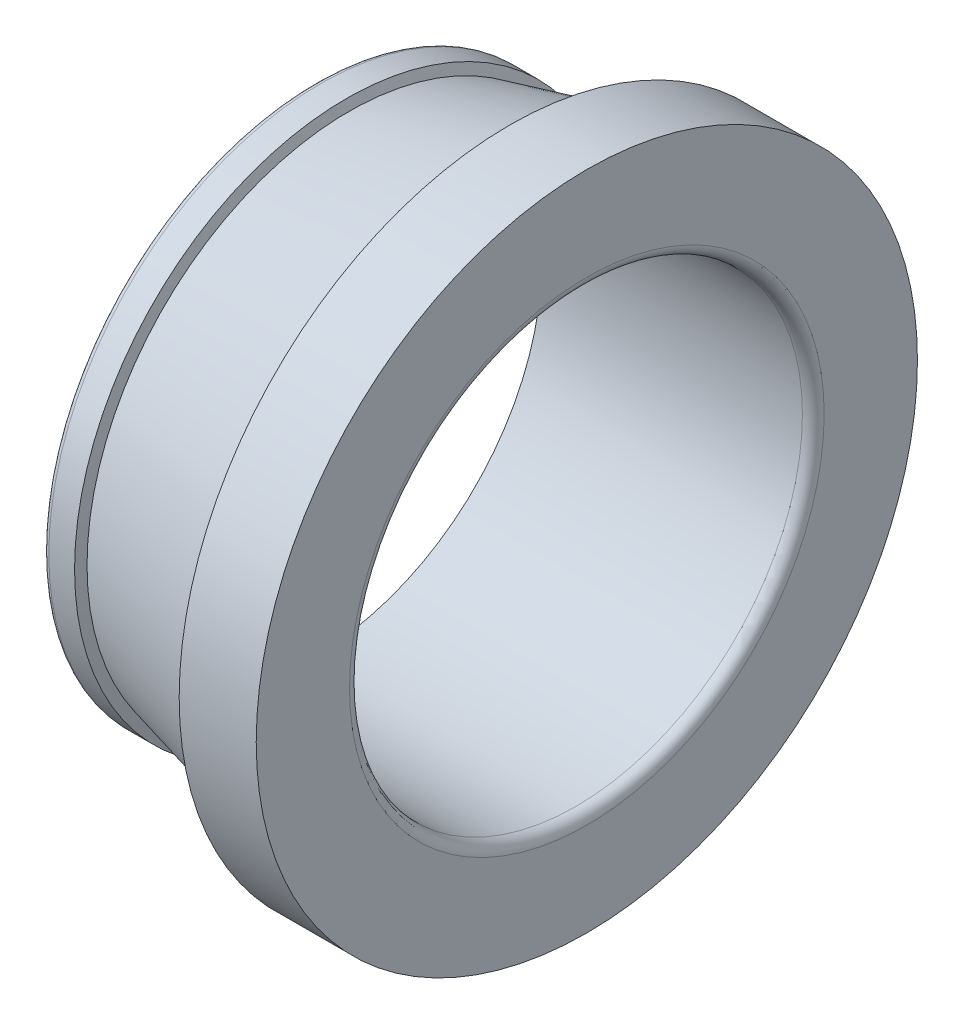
ISO-10303-21;
HEADER;
FILE_DESCRIPTION(('STEP AP214'),'2;1');
FILE_NAME('part.step','',(''),(''),'','','');
FILE_SCHEMA(('AUTOMOTIVE_DESIGN { 1 0 10303 214 1 1 1 1 }'));
ENDSEC;
DATA;
#1=APPLICATION_CONTEXT('core data for automotive mechanical design processes');
#2=APPLICATION_PROTOCOL_DEFINITION('international standard','automotive_design',2000,#1);
#3=PRODUCT_CONTEXT('',#1,'mechanical');
#4=PRODUCT('Part','Part','',(#3));
#5=PRODUCT_RELATED_PRODUCT_CATEGORY('part','',(#4));
#6=PRODUCT_DEFINITION_FORMATION('','',#4);
#7=PRODUCT_DEFINITION_CONTEXT('part definition',#1,'design');
#8=PRODUCT_DEFINITION('design','',#6,#7);
#9=PRODUCT_DEFINITION_SHAPE('','',#8);
#10=(LENGTH_UNIT() NAMED_UNIT(*) SI_UNIT(.MILLI.,.METRE.));
#11=(NAMED_UNIT(*) PLANE_ANGLE_UNIT() SI_UNIT($,.RADIAN.));
#12=(NAMED_UNIT(*) SI_UNIT($,.STERADIAN.) SOLID_ANGLE_UNIT());
#13=UNCERTAINTY_MEASURE_WITH_UNIT(LENGTH_MEASURE(1.E-05),#10,'distance_accuracy_value','');
#14=(GEOMETRIC_REPRESENTATION_CONTEXT(3) GLOBAL_UNCERTAINTY_ASSIGNED_CONTEXT((#13)) GLOBAL_UNIT_ASSIGNED_CONTEXT((#10,
#11,#12)) REPRESENTATION_CONTEXT('',''));
#15=CARTESIAN_POINT('',(0.,0.,0.));
#16=DIRECTION('',(0.,0.,1.));
#17=DIRECTION('',(1.,0.,0.));
#18=AXIS2_PLACEMENT_3D('',#15,#16,#17);
#19=CARTESIAN_POINT('',(0.,14.7,0.));
#20=DIRECTION('',(1.,0.,0.));
#21=DIRECTION('',(0.,0.,-1.));
#22=AXIS2_PLACEMENT_3D('',#19,#20,#21);
#23=PLANE('',#22);
#24=CARTESIAN_POINT('',(0.,0.,0.));
#25=DIRECTION('',(-1.,0.,0.));
#26=DIRECTION('',(0.,0.,1.));
#27=AXIS2_PLACEMENT_3D('',#24,#25,#26);
#28=CIRCLE('',#27,12.5);
#29=CARTESIAN_POINT('',(0.,0.,12.5));
#30=VERTEX_POINT('',#29);
#31=EDGE_CURVE('E9',#30,#30,#28,.T.);
#32=ORIENTED_EDGE('',*,*,#31,.F.);
#33=EDGE_LOOP('',(#32));
#34=FACE_BOUND('',#33,.T.);
#35=CARTESIAN_POINT('',(0.,0.,0.));
#36=DIRECTION('',(-1.,0.,0.));
#37=DIRECTION('',(0.,0.,1.));
#38=AXIS2_PLACEMENT_3D('',#35,#36,#37);
#39=CIRCLE('',#38,14.7);
#40=CARTESIAN_POINT('',(0.,0.,14.7));
#41=VERTEX_POINT('',#40);
#42=EDGE_CURVE('E48',#41,#41,#39,.T.);
#43=ORIENTED_EDGE('',*,*,#42,.T.);
#44=EDGE_LOOP('',(#43));
#45=FACE_BOUND('',#44,.T.);
#46=ADVANCED_FACE('F14',(#34,#45),#23,.F.);
#47=CARTESIAN_POINT('',(0.,0.,0.));
#48=DIRECTION('',(-1.,0.,0.));
#49=DIRECTION('',(0.,0.,1.));
#50=AXIS2_PLACEMENT_3D('',#47,#48,#49);
#51=CYLINDRICAL_SURFACE('',#50,12.5);
#52=CARTESIAN_POINT('',(14.4,0.,0.));
#53=DIRECTION('',(-1.,0.,0.));
#54=DIRECTION('',(0.,0.,1.));
#55=AXIS2_PLACEMENT_3D('',#52,#53,#54);
#56=CIRCLE('',#55,12.5);
#57=CARTESIAN_POINT('',(14.4,0.,12.5));
#58=VERTEX_POINT('',#57);
#59=EDGE_CURVE('E20',#58,#58,#56,.T.);
#60=ORIENTED_EDGE('',*,*,#59,.F.);
#61=EDGE_LOOP('',(#60));
#62=FACE_BOUND('',#61,.T.);
#63=ORIENTED_EDGE('',*,*,#31,.T.);
#64=EDGE_LOOP('',(#63));
#65=FACE_BOUND('',#64,.T.);
#66=ADVANCED_FACE('F72',(#62,#65),#51,.F.);
#67=CARTESIAN_POINT('',(14.4,0.,0.));
#68=DIRECTION('',(-1.,0.,0.));
#69=DIRECTION('',(0.,0.,1.));
#70=AXIS2_PLACEMENT_3D('',#67,#68,#69);
#71=TOROIDAL_SURFACE('',#70,13.1,0.6);
#72=CARTESIAN_POINT('',(15.,0.,0.));
#73=DIRECTION('',(-1.,0.,0.));
#74=DIRECTION('',(0.,0.,1.));
#75=AXIS2_PLACEMENT_3D('',#72,#73,#74);
#76=CIRCLE('',#75,13.1);
#77=CARTESIAN_POINT('',(15.,0.,13.1));
#78=VERTEX_POINT('',#77);
#79=EDGE_CURVE('E24',#78,#78,#76,.T.);
#80=ORIENTED_EDGE('',*,*,#79,.F.);
#81=EDGE_LOOP('',(#80));
#82=FACE_BOUND('',#81,.T.);
#83=ORIENTED_EDGE('',*,*,#59,.T.);
#84=EDGE_LOOP('',(#83));
#85=FACE_BOUND('',#84,.T.);
#86=ADVANCED_FACE('F77',(#82,#85),#71,.T.);
#87=CARTESIAN_POINT('',(15.,13.1,0.));
#88=DIRECTION('',(-1.,0.,0.));
#89=DIRECTION('',(0.,0.,1.));
#90=AXIS2_PLACEMENT_3D('',#87,#88,#89);
#91=PLANE('',#90);
#92=CARTESIAN_POINT('',(15.,0.,0.));
#93=DIRECTION('',(-1.,0.,0.));
#94=DIRECTION('',(0.,0.,1.));
#95=AXIS2_PLACEMENT_3D('',#92,#93,#94);
#96=CIRCLE('',#95,18.25);
#97=CARTESIAN_POINT('',(15.,0.,18.25));
#98=VERTEX_POINT('',#97);
#99=EDGE_CURVE('E28',#98,#98,#96,.T.);
#100=ORIENTED_EDGE('',*,*,#99,.F.);
#101=EDGE_LOOP('',(#100));
#102=FACE_BOUND('',#101,.T.);
#103=ORIENTED_EDGE('',*,*,#79,.T.);
#104=EDGE_LOOP('',(#103));
#105=FACE_BOUND('',#104,.T.);
#106=ADVANCED_FACE('F82',(#102,#105),#91,.F.);
#107=CARTESIAN_POINT('',(0.,0.,0.));
#108=DIRECTION('',(-1.,0.,0.));
#109=DIRECTION('',(0.,0.,1.));
#110=AXIS2_PLACEMENT_3D('',#107,#108,#109);
#111=CYLINDRICAL_SURFACE('',#110,18.25);
#112=CARTESIAN_POINT('',(10.7463511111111,0.,0.));
#113=DIRECTION('',(-1.,0.,0.));
#114=DIRECTION('',(0.,0.,1.));
#115=AXIS2_PLACEMENT_3D('',#112,#113,#114);
#116=CIRCLE('',#115,18.25);
#117=CARTESIAN_POINT('',(10.7463511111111,0.,18.25));
#118=VERTEX_POINT('',#117);
#119=EDGE_CURVE('E33',#118,#118,#116,.T.);
#120=ORIENTED_EDGE('',*,*,#119,.F.);
#121=EDGE_LOOP('',(#120));
#122=FACE_BOUND('',#121,.T.);
#123=ORIENTED_EDGE('',*,*,#99,.T.);
#124=EDGE_LOOP('',(#123));
#125=FACE_BOUND('',#124,.T.);
#126=ADVANCED_FACE('F88',(#122,#125),#111,.T.);
#127=CARTESIAN_POINT('',(10.7463511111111,0.,0.));
#128=DIRECTION('',(-1.,0.,0.));
#129=DIRECTION('',(0.,0.,1.));
#130=AXIS2_PLACEMENT_3D('',#127,#128,#129);
#131=CONICAL_SURFACE('',#130,18.25,1.29161638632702);
#132=CARTESIAN_POINT('',(11.1674980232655,0.,0.));
#133=DIRECTION('',(-1.,0.,0.));
#134=DIRECTION('',(0.,0.,1.));
#135=AXIS2_PLACEMENT_3D('',#132,#133,#134);
#136=CIRCLE('',#135,16.7808828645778);
#137=CARTESIAN_POINT('',(11.1674980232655,0.,16.7808828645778));
#138=VERTEX_POINT('',#137);
#139=EDGE_CURVE('E36',#138,#138,#136,.T.);
#140=ORIENTED_EDGE('',*,*,#139,.F.);
#141=EDGE_LOOP('',(#140));
#142=FACE_BOUND('',#141,.T.);
#143=ORIENTED_EDGE('',*,*,#119,.T.);
#144=EDGE_LOOP('',(#143));
#145=FACE_BOUND('',#144,.T.);
#146=ADVANCED_FACE('F92',(#142,#145),#131,.F.);
#147=CARTESIAN_POINT('',(11.1674980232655,0.,0.));
#148=DIRECTION('',(1.,0.,0.));
#149=DIRECTION('',(0.,0.,-1.));
#150=AXIS2_PLACEMENT_3D('',#147,#148,#149);
#151=CONICAL_SURFACE('',#150,16.7808828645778,0.24427335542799);
#152=CARTESIAN_POINT('',(1.87540031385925,0.,0.));
#153=DIRECTION('',(-1.,0.,0.));
#154=DIRECTION('',(0.,0.,1.));
#155=AXIS2_PLACEMENT_3D('',#152,#153,#154);
#156=CIRCLE('',#155,14.4648206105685);
#157=CARTESIAN_POINT('',(1.87540031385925,0.,14.4648206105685));
#158=VERTEX_POINT('',#157);
#159=EDGE_CURVE('E39',#158,#158,#156,.T.);
#160=ORIENTED_EDGE('',*,*,#159,.F.);
#161=EDGE_LOOP('',(#160));
#162=FACE_BOUND('',#161,.T.);
#163=ORIENTED_EDGE('',*,*,#139,.T.);
#164=EDGE_LOOP('',(#163));
#165=FACE_BOUND('',#164,.T.);
#166=ADVANCED_FACE('F68',(#162,#165),#151,.T.);
#167=CARTESIAN_POINT('',(1.87540031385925,0.,0.));
#168=DIRECTION('',(-1.,0.,0.));
#169=DIRECTION('',(0.,0.,1.));
#170=AXIS2_PLACEMENT_3D('',#167,#168,#169);
#171=CONICAL_SURFACE('',#170,14.4648206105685,1.29161638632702);
#172=CARTESIAN_POINT('',(1.72198222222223,0.,0.));
#173=DIRECTION('',(-1.,0.,0.));
#174=DIRECTION('',(0.,0.,1.));
#175=AXIS2_PLACEMENT_3D('',#172,#173,#174);
#176=CIRCLE('',#175,15.);
#177=CARTESIAN_POINT('',(1.72198222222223,0.,15.));
#178=VERTEX_POINT('',#177);
#179=EDGE_CURVE('E42',#178,#178,#176,.T.);
#180=ORIENTED_EDGE('',*,*,#179,.F.);
#181=EDGE_LOOP('',(#180));
#182=FACE_BOUND('',#181,.T.);
#183=ORIENTED_EDGE('',*,*,#159,.T.);
#184=EDGE_LOOP('',(#183));
#185=FACE_BOUND('',#184,.T.);
#186=ADVANCED_FACE('F61',(#182,#185),#171,.T.);
#187=CARTESIAN_POINT('',(0.,0.,0.));
#188=DIRECTION('',(-1.,0.,0.));
#189=DIRECTION('',(0.,0.,1.));
#190=AXIS2_PLACEMENT_3D('',#187,#188,#189);
#191=CYLINDRICAL_SURFACE('',#190,15.);
#192=ORIENTED_EDGE('',*,*,#179,.T.);
#193=EDGE_LOOP('',(#192));
#194=FACE_BOUND('',#193,.T.);
#195=CARTESIAN_POINT('',(0.3,0.,0.));
#196=DIRECTION('',(-1.,0.,0.));
#197=DIRECTION('',(0.,0.,1.));
#198=AXIS2_PLACEMENT_3D('',#195,#196,#197);
#199=CIRCLE('',#198,15.);
#200=CARTESIAN_POINT('',(0.3,0.,15.));
#201=VERTEX_POINT('',#200);
#202=EDGE_CURVE('E45',#201,#201,#199,.T.);
#203=ORIENTED_EDGE('',*,*,#202,.F.);
#204=EDGE_LOOP('',(#203));
#205=FACE_BOUND('',#204,.T.);
#206=ADVANCED_FACE('F56',(#194,#205),#191,.T.);
#207=CARTESIAN_POINT('',(0.3,0.,0.));
#208=DIRECTION('',(-1.,0.,0.));
#209=DIRECTION('',(0.,0.,1.));
#210=AXIS2_PLACEMENT_3D('',#207,#208,#209);
#211=TOROIDAL_SURFACE('',#210,14.7,0.3);
#212=ORIENTED_EDGE('',*,*,#42,.F.);
#213=EDGE_LOOP('',(#212));
#214=FACE_BOUND('',#213,.T.);
#215=ORIENTED_EDGE('',*,*,#202,.T.);
#216=EDGE_LOOP('',(#215));
#217=FACE_BOUND('',#216,.T.);
#218=ADVANCED_FACE('F53',(#214,#217),#211,.T.);
#219=CLOSED_SHELL('',(#46,#66,#86,#106,#126,#146,#166,#186,#206,#218));
#220=MANIFOLD_SOLID_BREP('B1',#219);
#221=ADVANCED_BREP_SHAPE_REPRESENTATION('',(#18,#220),#14);
#222=SHAPE_DEFINITION_REPRESENTATION(#9,#221);
ENDSEC;
END-ISO-10303-21;
